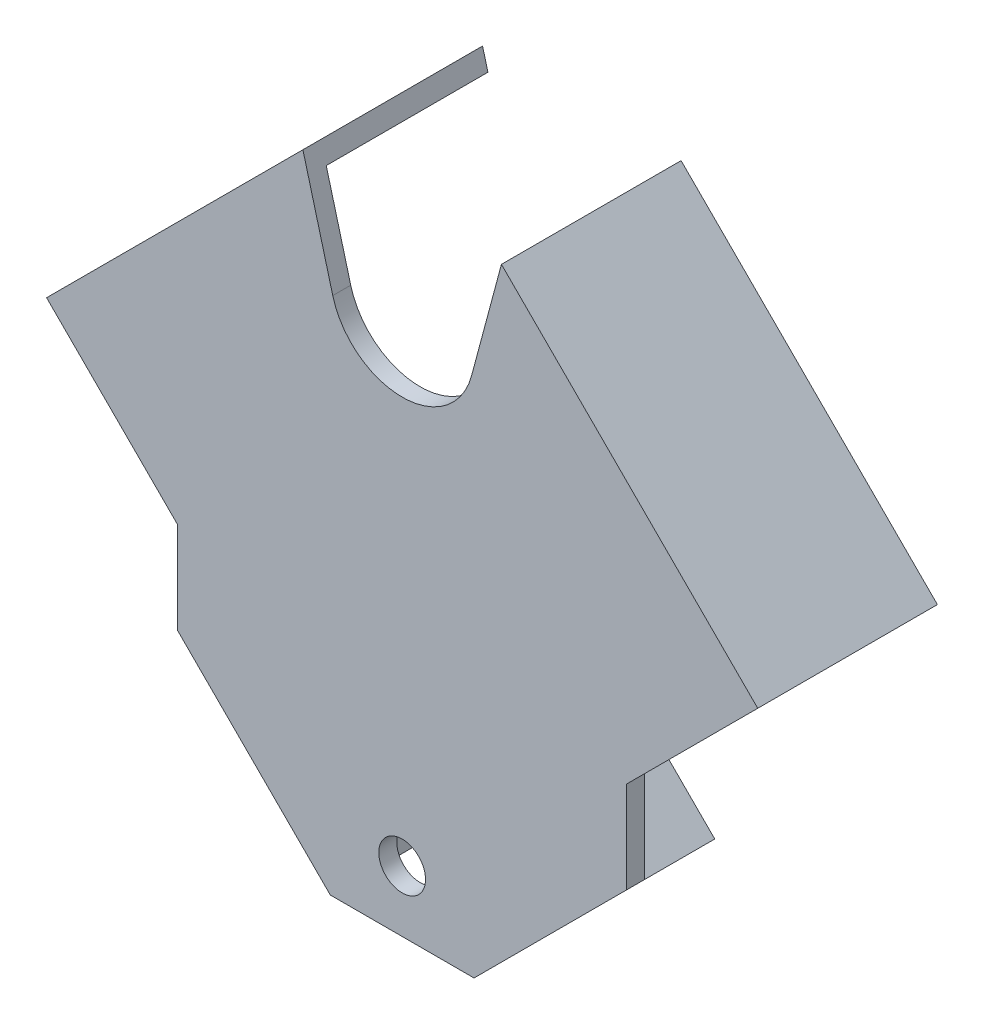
ISO-10303-21;
HEADER;
FILE_DESCRIPTION(('STEP AP214'),'2;1');
FILE_NAME('part.step','',(''),(''),'','','');
FILE_SCHEMA(('AUTOMOTIVE_DESIGN { 1 0 10303 214 1 1 1 1 }'));
ENDSEC;
DATA;
#1=APPLICATION_CONTEXT('core data for automotive mechanical design processes');
#2=APPLICATION_PROTOCOL_DEFINITION('international standard','automotive_design',2000,#1);
#3=PRODUCT_CONTEXT('',#1,'mechanical');
#4=PRODUCT('Part','Part','',(#3));
#5=PRODUCT_RELATED_PRODUCT_CATEGORY('part','',(#4));
#6=PRODUCT_DEFINITION_FORMATION('','',#4);
#7=PRODUCT_DEFINITION_CONTEXT('part definition',#1,'design');
#8=PRODUCT_DEFINITION('design','',#6,#7);
#9=PRODUCT_DEFINITION_SHAPE('','',#8);
#10=(LENGTH_UNIT() NAMED_UNIT(*) SI_UNIT(.MILLI.,.METRE.));
#11=(NAMED_UNIT(*) PLANE_ANGLE_UNIT() SI_UNIT($,.RADIAN.));
#12=(NAMED_UNIT(*) SI_UNIT($,.STERADIAN.) SOLID_ANGLE_UNIT());
#13=UNCERTAINTY_MEASURE_WITH_UNIT(LENGTH_MEASURE(1.E-05),#10,'distance_accuracy_value','');
#14=(GEOMETRIC_REPRESENTATION_CONTEXT(3) GLOBAL_UNCERTAINTY_ASSIGNED_CONTEXT((#13)) GLOBAL_UNIT_ASSIGNED_CONTEXT((#10,
#11,#12)) REPRESENTATION_CONTEXT('',''));
#15=CARTESIAN_POINT('',(0.,0.,0.));
#16=DIRECTION('',(0.,0.,1.));
#17=DIRECTION('',(1.,0.,0.));
#18=AXIS2_PLACEMENT_3D('',#15,#16,#17);
#19=CARTESIAN_POINT('',(0.,39.8578643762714,-136.728956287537));
#20=DIRECTION('',(0.,0.,1.));
#21=DIRECTION('',(1.,0.,0.));
#22=AXIS2_PLACEMENT_3D('',#19,#20,#21);
#23=CYLINDRICAL_SURFACE('',#22,5.);
#24=DIRECTION('',(0.,0.,1.));
#25=VECTOR('',#24,1.);
#26=CARTESIAN_POINT('',(-3.53553390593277,43.3933982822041,-136.728956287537));
#27=LINE('',#26,#25);
#28=CARTESIAN_POINT('',(-3.53553390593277,43.3933982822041,-14.662983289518));
#29=VERTEX_POINT('',#28);
#30=CARTESIAN_POINT('',(-3.53553390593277,43.3933982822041,-2.5));
#31=VERTEX_POINT('',#30);
#32=EDGE_CURVE('E362',#29,#31,#27,.T.);
#33=ORIENTED_EDGE('',*,*,#32,.F.);
#34=CARTESIAN_POINT('',(-3.53553390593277,43.3933982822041,-14.662983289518));
#35=CARTESIAN_POINT('',(-3.43975250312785,43.4892161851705,-14.643342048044));
#36=CARTESIAN_POINT('',(-3.33979429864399,43.5813519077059,-14.6262838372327));
#37=CARTESIAN_POINT('',(-3.13236702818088,43.7574423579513,-14.5965813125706));
#38=CARTESIAN_POINT('',(-3.02490093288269,43.8414002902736,-14.5839352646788));
#39=CARTESIAN_POINT('',(-2.80345193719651,44.0002316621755,-14.5623128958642));
#40=CARTESIAN_POINT('',(-2.68948289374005,44.0751234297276,-14.5533290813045));
#41=CARTESIAN_POINT('',(-2.45566048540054,44.2154230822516,-14.5382527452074));
#42=CARTESIAN_POINT('',(-2.3358066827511,44.2808302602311,-14.5321604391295));
#43=CARTESIAN_POINT('',(-2.09118041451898,44.4016027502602,-14.522181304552));
#44=CARTESIAN_POINT('',(-1.96641207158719,44.456976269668,-14.5182926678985));
#45=CARTESIAN_POINT('',(-1.71273154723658,44.5573492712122,-14.5120972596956));
#46=CARTESIAN_POINT('',(-1.58381928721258,44.6023485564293,-14.5097905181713));
#47=CARTESIAN_POINT('',(-1.32268001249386,44.6816748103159,-14.5062369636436));
#48=CARTESIAN_POINT('',(-1.19045164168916,44.7159973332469,-14.5049905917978));
#49=CARTESIAN_POINT('',(-0.92368212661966,44.7736988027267,-14.5031492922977));
#50=CARTESIAN_POINT('',(-0.789141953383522,44.7970822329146,-14.5025540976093));
#51=CARTESIAN_POINT('',(-0.515287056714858,44.8332053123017,-14.5017179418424));
#52=CARTESIAN_POINT('',(-0.375936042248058,44.8456706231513,-14.5014860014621));
#53=CARTESIAN_POINT('',(-0.0966776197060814,44.8588837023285,-14.5012419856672));
#54=CARTESIAN_POINT('',(0.0432297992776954,44.859631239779,-14.5012299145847));
#55=CARTESIAN_POINT('',(0.32262407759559,44.8494028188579,-14.5014159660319));
#56=CARTESIAN_POINT('',(0.462110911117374,44.8384261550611,-14.5016141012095));
#57=CARTESIAN_POINT('',(0.739721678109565,44.8048198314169,-14.5023636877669));
#58=CARTESIAN_POINT('',(0.877845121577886,44.7821861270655,-14.5029152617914));
#59=CARTESIAN_POINT('',(1.15245504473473,44.7252677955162,-14.5046678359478));
#60=CARTESIAN_POINT('',(1.28892845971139,44.6909201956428,-14.5058723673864));
#61=CARTESIAN_POINT('',(1.55848272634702,44.6108530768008,-14.5093699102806));
#62=CARTESIAN_POINT('',(1.69156356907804,44.5651335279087,-14.5116629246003));
#63=CARTESIAN_POINT('',(1.95327994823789,44.4626903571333,-14.5178995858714));
#64=CARTESIAN_POINT('',(2.08191862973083,44.4059747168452,-14.5218420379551));
#65=CARTESIAN_POINT('',(2.33385504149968,44.2819858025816,-14.5320439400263));
#66=CARTESIAN_POINT('',(2.45715354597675,44.2147140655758,-14.5383030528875));
#67=CARTESIAN_POINT('',(2.75205563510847,44.0372976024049,-14.557432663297));
#68=CARTESIAN_POINT('',(2.92024339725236,43.9215350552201,-14.5720136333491));
#69=CARTESIAN_POINT('',(3.16041906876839,43.7337022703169,-14.6006015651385));
#70=CARTESIAN_POINT('',(3.23847130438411,43.6687151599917,-14.6112524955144));
#71=CARTESIAN_POINT('',(3.3902912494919,43.5343032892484,-14.6351163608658));
#72=CARTESIAN_POINT('',(3.46405744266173,43.4648769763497,-14.6483301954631));
#73=CARTESIAN_POINT('',(3.5355339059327,43.3933982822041,-14.662983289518));
#74=B_SPLINE_CURVE_WITH_KNOTS('',3,(#34,#35,#36,#37,#38,#39,#40,#41,#42,#43,#44,#45,#46,#47,#48,
#49,#50,#51,#52,#53,#54,#55,#56,#57,#58,#59,#60,#61,#62,#63,#64,#65,#66,#67,#68,#69,#70,#71,#72,
#73),.UNSPECIFIED.,.F.,.F.,(4,2,2,2,2,2,2,2,2,2,2,2,2,2,2,2,2,2,2,4),(0.,0.410520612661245,
0.820879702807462,1.23039485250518,1.63994051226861,2.04914964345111,2.45836654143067,
2.86775360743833,3.27697272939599,3.69620139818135,4.11543832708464,4.53470048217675,
4.95410820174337,5.37580711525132,5.79750713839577,6.21890220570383,6.64023597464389,
7.25240776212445,7.55859012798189,7.86488016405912),.UNSPECIFIED.);
#75=CARTESIAN_POINT('',(3.5355339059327,43.3933982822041,-14.662983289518));
#76=VERTEX_POINT('',#75);
#77=EDGE_CURVE('E306',#29,#76,#74,.T.);
#78=ORIENTED_EDGE('',*,*,#77,.T.);
#79=DIRECTION('',(0.,0.,1.));
#80=VECTOR('',#79,1.);
#81=CARTESIAN_POINT('',(3.5355339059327,43.3933982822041,-136.728956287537));
#82=LINE('',#81,#80);
#83=CARTESIAN_POINT('',(3.5355339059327,43.3933982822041,-2.5));
#84=VERTEX_POINT('',#83);
#85=EDGE_CURVE('E575',#76,#84,#82,.T.);
#86=ORIENTED_EDGE('',*,*,#85,.T.);
#87=CARTESIAN_POINT('',(0.,39.8578643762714,-2.5));
#88=DIRECTION('',(0.,0.,1.));
#89=DIRECTION('',(1.,0.,0.));
#90=AXIS2_PLACEMENT_3D('',#87,#88,#89);
#91=CIRCLE('',#90,5.);
#92=EDGE_CURVE('E366',#84,#31,#91,.T.);
#93=ORIENTED_EDGE('',*,*,#92,.T.);
#94=EDGE_LOOP('',(#33,#78,#86,#93));
#95=FACE_BOUND('',#94,.T.);
#96=ADVANCED_FACE('F37',(#95),#23,.F.);
#97=CARTESIAN_POINT('',(0.,39.8578643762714,-136.728956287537));
#98=DIRECTION('',(0.,0.,1.));
#99=DIRECTION('',(1.,0.,0.));
#100=AXIS2_PLACEMENT_3D('',#97,#98,#99);
#101=CYLINDRICAL_SURFACE('',#100,10.);
#102=DIRECTION('',(0.,0.,1.));
#103=VECTOR('',#102,1.);
#104=CARTESIAN_POINT('',(7.07106781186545,46.9289321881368,-136.728956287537));
#105=LINE('',#104,#103);
#106=CARTESIAN_POINT('',(7.07106781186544,46.9289321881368,-14.5));
#107=VERTEX_POINT('',#106);
#108=CARTESIAN_POINT('',(7.07106781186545,46.9289321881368,-2.5));
#109=VERTEX_POINT('',#108);
#110=EDGE_CURVE('E396',#107,#109,#105,.T.);
#111=ORIENTED_EDGE('',*,*,#110,.F.);
#112=CARTESIAN_POINT('',(0.,39.8578643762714,-14.5));
#113=DIRECTION('',(0.,0.,1.));
#114=DIRECTION('',(1.,0.,0.));
#115=AXIS2_PLACEMENT_3D('',#112,#113,#114);
#116=CIRCLE('',#115,10.);
#117=CARTESIAN_POINT('',(-7.07106781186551,46.9289321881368,-14.5));
#118=VERTEX_POINT('',#117);
#119=EDGE_CURVE('E273',#107,#118,#116,.T.);
#120=ORIENTED_EDGE('',*,*,#119,.T.);
#121=DIRECTION('',(0.,0.,1.));
#122=VECTOR('',#121,1.);
#123=CARTESIAN_POINT('',(-7.07106781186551,46.9289321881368,-136.728956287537));
#124=LINE('',#123,#122);
#125=CARTESIAN_POINT('',(-7.07106781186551,46.9289321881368,-2.5));
#126=VERTEX_POINT('',#125);
#127=EDGE_CURVE('E391',#118,#126,#124,.T.);
#128=ORIENTED_EDGE('',*,*,#127,.T.);
#129=CARTESIAN_POINT('',(0.,39.8578643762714,-2.5));
#130=DIRECTION('',(0.,0.,-1.));
#131=DIRECTION('',(1.,0.,0.));
#132=AXIS2_PLACEMENT_3D('',#129,#130,#131);
#133=CIRCLE('',#132,10.);
#134=EDGE_CURVE('E390',#126,#109,#133,.T.);
#135=ORIENTED_EDGE('',*,*,#134,.T.);
#136=EDGE_LOOP('',(#111,#120,#128,#135));
#137=FACE_BOUND('',#136,.T.);
#138=ADVANCED_FACE('F332',(#137),#101,.T.);
#139=CARTESIAN_POINT('',(0.,150.,-2.5));
#140=DIRECTION('',(0.,0.,1.));
#141=DIRECTION('',(1.,0.,0.));
#142=AXIS2_PLACEMENT_3D('',#139,#140,#141);
#143=PLANE('',#142);
#144=CARTESIAN_POINT('',(0.,17.,-2.5));
#145=DIRECTION('',(0.,0.,1.));
#146=DIRECTION('',(1.,0.,0.));
#147=AXIS2_PLACEMENT_3D('',#144,#145,#146);
#148=CIRCLE('',#147,6.5);
#149=CARTESIAN_POINT('',(6.5,17.,-2.5));
#150=VERTEX_POINT('',#149);
#151=EDGE_CURVE('E446',#150,#150,#148,.T.);
#152=ORIENTED_EDGE('',*,*,#151,.T.);
#153=EDGE_LOOP('',(#152));
#154=FACE_BOUND('',#153,.T.);
#155=DIRECTION('',(0.707106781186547,-0.707106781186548,0.));
#156=VECTOR('',#155,1.);
#157=CARTESIAN_POINT('',(-29.9289321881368,17.,-2.5));
#158=LINE('',#157,#156);
#159=CARTESIAN_POINT('',(-27.8076118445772,14.8786796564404,-2.5));
#160=VERTEX_POINT('',#159);
#161=CARTESIAN_POINT('',(-20.,7.07106781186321,-2.5));
#162=VERTEX_POINT('',#161);
#163=EDGE_CURVE('E381',#160,#162,#158,.T.);
#164=ORIENTED_EDGE('',*,*,#163,.F.);
#165=CARTESIAN_POINT('',(-25.6862915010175,17.,-2.5));
#166=DIRECTION('',(0.,0.,1.));
#167=DIRECTION('',(1.,0.,0.));
#168=AXIS2_PLACEMENT_3D('',#165,#166,#167);
#169=CIRCLE('',#168,3.);
#170=CARTESIAN_POINT('',(-27.8076118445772,19.1213203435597,-2.5));
#171=VERTEX_POINT('',#170);
#172=EDGE_CURVE('E543',#160,#171,#169,.F.);
#173=ORIENTED_EDGE('',*,*,#172,.T.);
#174=DIRECTION('',(-0.707106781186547,-0.707106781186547,0.));
#175=VECTOR('',#174,1.);
#176=CARTESIAN_POINT('',(-3.53553390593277,43.3933982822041,-2.5));
#177=LINE('',#176,#175);
#178=EDGE_CURVE('E371',#31,#171,#177,.T.);
#179=ORIENTED_EDGE('',*,*,#178,.F.);
#180=ORIENTED_EDGE('',*,*,#92,.F.);
#181=DIRECTION('',(-0.707106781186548,0.707106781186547,0.));
#182=VECTOR('',#181,1.);
#183=CARTESIAN_POINT('',(29.9289321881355,17.0000000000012,-2.5));
#184=LINE('',#183,#182);
#185=CARTESIAN_POINT('',(27.8076118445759,19.1213203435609,-2.5));
#186=VERTEX_POINT('',#185);
#187=EDGE_CURVE('E573',#186,#84,#184,.T.);
#188=ORIENTED_EDGE('',*,*,#187,.F.);
#189=CARTESIAN_POINT('',(25.6862915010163,17.0000000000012,-2.5));
#190=DIRECTION('',(0.,0.,1.));
#191=DIRECTION('',(1.,0.,0.));
#192=AXIS2_PLACEMENT_3D('',#189,#190,#191);
#193=CIRCLE('',#192,3.);
#194=CARTESIAN_POINT('',(27.8076118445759,14.8786796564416,-2.5));
#195=VERTEX_POINT('',#194);
#196=EDGE_CURVE('E541',#186,#195,#193,.F.);
#197=ORIENTED_EDGE('',*,*,#196,.T.);
#198=DIRECTION('',(0.707106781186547,0.707106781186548,0.));
#199=VECTOR('',#198,1.);
#200=CARTESIAN_POINT('',(20.,7.0710678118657,-2.5));
#201=LINE('',#200,#199);
#202=CARTESIAN_POINT('',(20.,7.0710678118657,-2.5));
#203=VERTEX_POINT('',#202);
#204=EDGE_CURVE('E576',#203,#195,#201,.T.);
#205=ORIENTED_EDGE('',*,*,#204,.F.);
#206=DIRECTION('',(0.,1.,0.));
#207=VECTOR('',#206,1.);
#208=CARTESIAN_POINT('',(20.,2.22044604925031E-13,-2.5));
#209=LINE('',#208,#207);
#210=CARTESIAN_POINT('',(20.,2.22044604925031E-13,-2.5));
#211=VERTEX_POINT('',#210);
#212=EDGE_CURVE('E402',#211,#203,#209,.T.);
#213=ORIENTED_EDGE('',*,*,#212,.F.);
#214=DIRECTION('',(1.,0.,0.));
#215=VECTOR('',#214,1.);
#216=CARTESIAN_POINT('',(-20.,0.,-2.5));
#217=LINE('',#216,#215);
#218=CARTESIAN_POINT('',(-20.,0.,-2.5));
#219=VERTEX_POINT('',#218);
#220=EDGE_CURVE('E455',#219,#211,#217,.T.);
#221=ORIENTED_EDGE('',*,*,#220,.F.);
#222=DIRECTION('',(0.,-1.,0.));
#223=VECTOR('',#222,1.);
#224=CARTESIAN_POINT('',(-20.,0.,-2.5));
#225=LINE('',#224,#223);
#226=EDGE_CURVE('E380',#162,#219,#225,.T.);
#227=ORIENTED_EDGE('',*,*,#226,.F.);
#228=EDGE_LOOP('',(#164,#173,#179,#180,#188,#197,#205,#213,#221,#227));
#229=FACE_BOUND('',#228,.T.);
#230=ADVANCED_FACE('F357',(#154,#229),#143,.F.);
#231=DIRECTION('',(0.707106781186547,0.707106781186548,0.));
#232=VECTOR('',#231,1.);
#233=CARTESIAN_POINT('',(-7.07106781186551,46.9289321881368,-2.5));
#234=LINE('',#233,#232);
#235=CARTESIAN_POINT('',(-37.0000000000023,17.,-2.5));
#236=VERTEX_POINT('',#235);
#237=EDGE_CURVE('E387',#236,#126,#234,.T.);
#238=ORIENTED_EDGE('',*,*,#237,.F.);
#239=DIRECTION('',(0.707106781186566,-0.707106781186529,0.));
#240=VECTOR('',#239,1.);
#241=CARTESIAN_POINT('',(-62.5000000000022,42.5,-2.5));
#242=LINE('',#241,#240);
#243=CARTESIAN_POINT('',(-62.5000000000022,42.5,-2.5));
#244=VERTEX_POINT('',#243);
#245=EDGE_CURVE('E462',#244,#236,#242,.T.);
#246=ORIENTED_EDGE('',*,*,#245,.F.);
#247=DIRECTION('',(0.,-1.,0.));
#248=VECTOR('',#247,1.);
#249=CARTESIAN_POINT('',(-62.5000000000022,68.0216387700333,-2.5));
#250=LINE('',#249,#248);
#251=CARTESIAN_POINT('',(-62.5000000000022,68.0216387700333,-2.5));
#252=VERTEX_POINT('',#251);
#253=EDGE_CURVE('E505',#252,#244,#250,.T.);
#254=ORIENTED_EDGE('',*,*,#253,.F.);
#255=DIRECTION('',(0.707106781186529,-0.707106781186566,0.));
#256=VECTOR('',#255,1.);
#257=CARTESIAN_POINT('',(-95.4265181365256,100.948156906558,-2.5));
#258=LINE('',#257,#256);
#259=CARTESIAN_POINT('',(-95.4265181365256,100.948156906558,-2.5));
#260=VERTEX_POINT('',#259);
#261=EDGE_CURVE('E503',#260,#252,#258,.T.);
#262=ORIENTED_EDGE('',*,*,#261,.F.);
#263=DIRECTION('',(-0.707106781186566,-0.707106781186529,0.));
#264=VECTOR('',#263,1.);
#265=CARTESIAN_POINT('',(-26.1300535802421,170.244621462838,-2.5));
#266=LINE('',#265,#264);
#267=CARTESIAN_POINT('',(-26.1300535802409,170.244621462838,-2.5));
#268=VERTEX_POINT('',#267);
#269=EDGE_CURVE('E500',#268,#260,#266,.T.);
#270=ORIENTED_EDGE('',*,*,#269,.F.);
#271=DIRECTION('',(-0.258819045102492,0.965925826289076,0.));
#272=VECTOR('',#271,1.);
#273=CARTESIAN_POINT('',(-19.3185165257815,144.82361909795,-2.5));
#274=LINE('',#273,#272);
#275=CARTESIAN_POINT('',(-19.3185165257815,144.82361909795,-2.5));
#276=VERTEX_POINT('',#275);
#277=EDGE_CURVE('E497',#276,#268,#274,.T.);
#278=ORIENTED_EDGE('',*,*,#277,.F.);
#279=CARTESIAN_POINT('',(0.,150.,-2.5));
#280=DIRECTION('',(0.,0.,-1.));
#281=DIRECTION('',(1.,0.,0.));
#282=AXIS2_PLACEMENT_3D('',#279,#280,#281);
#283=CIRCLE('',#282,20.);
#284=CARTESIAN_POINT('',(19.3185165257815,144.82361909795,-2.5));
#285=VERTEX_POINT('',#284);
#286=EDGE_CURVE('E495',#285,#276,#283,.T.);
#287=ORIENTED_EDGE('',*,*,#286,.F.);
#288=DIRECTION('',(-0.258819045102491,-0.965925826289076,0.));
#289=VECTOR('',#288,1.);
#290=CARTESIAN_POINT('',(19.3185165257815,144.82361909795,-2.5));
#291=LINE('',#290,#289);
#292=CARTESIAN_POINT('',(26.1300535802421,170.244621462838,-2.5));
#293=VERTEX_POINT('',#292);
#294=EDGE_CURVE('E493',#293,#285,#291,.T.);
#295=ORIENTED_EDGE('',*,*,#294,.F.);
#296=DIRECTION('',(-0.707106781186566,0.707106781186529,0.));
#297=VECTOR('',#296,1.);
#298=CARTESIAN_POINT('',(26.1300535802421,170.244621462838,-2.5));
#299=LINE('',#298,#297);
#300=CARTESIAN_POINT('',(95.4265181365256,100.948156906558,-2.5));
#301=VERTEX_POINT('',#300);
#302=EDGE_CURVE('E490',#301,#293,#299,.T.);
#303=ORIENTED_EDGE('',*,*,#302,.F.);
#304=DIRECTION('',(0.707106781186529,0.707106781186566,0.));
#305=VECTOR('',#304,1.);
#306=CARTESIAN_POINT('',(95.4265181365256,100.948156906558,-2.5));
#307=LINE('',#306,#305);
#308=CARTESIAN_POINT('',(62.5000000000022,68.0216387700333,-2.5));
#309=VERTEX_POINT('',#308);
#310=EDGE_CURVE('E487',#309,#301,#307,.T.);
#311=ORIENTED_EDGE('',*,*,#310,.F.);
#312=DIRECTION('',(0.,1.,0.));
#313=VECTOR('',#312,1.);
#314=CARTESIAN_POINT('',(62.5000000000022,68.0216387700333,-2.5));
#315=LINE('',#314,#313);
#316=CARTESIAN_POINT('',(62.5000000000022,42.5,-2.5));
#317=VERTEX_POINT('',#316);
#318=EDGE_CURVE('E485',#317,#309,#315,.T.);
#319=ORIENTED_EDGE('',*,*,#318,.F.);
#320=DIRECTION('',(0.707106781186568,0.707106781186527,0.));
#321=VECTOR('',#320,1.);
#322=CARTESIAN_POINT('',(62.5000000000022,42.5,-2.5));
#323=LINE('',#322,#321);
#324=CARTESIAN_POINT('',(37.000000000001,17.0000000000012,-2.5));
#325=VERTEX_POINT('',#324);
#326=EDGE_CURVE('E483',#325,#317,#323,.T.);
#327=ORIENTED_EDGE('',*,*,#326,.F.);
#328=DIRECTION('',(0.707106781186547,-0.707106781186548,0.));
#329=VECTOR('',#328,1.);
#330=CARTESIAN_POINT('',(37.000000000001,17.0000000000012,-2.5));
#331=LINE('',#330,#329);
#332=EDGE_CURVE('E395',#109,#325,#331,.T.);
#333=ORIENTED_EDGE('',*,*,#332,.F.);
#334=ORIENTED_EDGE('',*,*,#134,.F.);
#335=EDGE_LOOP('',(#238,#246,#254,#262,#270,#278,#287,#295,#303,#311,#319,#327,#333,#334));
#336=FACE_BOUND('',#335,.T.);
#337=ADVANCED_FACE('F647',(#336),#143,.F.);
#338=CARTESIAN_POINT('',(0.,150.,2.5));
#339=DIRECTION('',(0.,0.,1.));
#340=DIRECTION('',(1.,0.,0.));
#341=AXIS2_PLACEMENT_3D('',#338,#339,#340);
#342=PLANE('',#341);
#343=DIRECTION('',(1.,0.,0.));
#344=VECTOR('',#343,1.);
#345=CARTESIAN_POINT('',(-20.,0.,2.5));
#346=LINE('',#345,#344);
#347=CARTESIAN_POINT('',(-20.,0.,2.5));
#348=VERTEX_POINT('',#347);
#349=CARTESIAN_POINT('',(20.,2.22044604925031E-13,2.5));
#350=VERTEX_POINT('',#349);
#351=EDGE_CURVE('E458',#348,#350,#346,.T.);
#352=ORIENTED_EDGE('',*,*,#351,.T.);
#353=DIRECTION('',(0.707106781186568,0.707106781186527,0.));
#354=VECTOR('',#353,1.);
#355=CARTESIAN_POINT('',(62.5000000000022,42.5,2.5));
#356=LINE('',#355,#354);
#357=CARTESIAN_POINT('',(62.5000000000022,42.5,2.5));
#358=VERTEX_POINT('',#357);
#359=EDGE_CURVE('E461',#350,#358,#356,.T.);
#360=ORIENTED_EDGE('',*,*,#359,.T.);
#361=DIRECTION('',(0.,1.,0.));
#362=VECTOR('',#361,1.);
#363=CARTESIAN_POINT('',(62.5000000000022,68.0216387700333,2.5));
#364=LINE('',#363,#362);
#365=CARTESIAN_POINT('',(62.5000000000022,68.0216387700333,2.5));
#366=VERTEX_POINT('',#365);
#367=EDGE_CURVE('E464',#358,#366,#364,.T.);
#368=ORIENTED_EDGE('',*,*,#367,.T.);
#369=DIRECTION('',(0.707106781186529,0.707106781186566,0.));
#370=VECTOR('',#369,1.);
#371=CARTESIAN_POINT('',(95.4265181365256,100.948156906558,2.5));
#372=LINE('',#371,#370);
#373=CARTESIAN_POINT('',(98.9620520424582,104.483690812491,2.5));
#374=VERTEX_POINT('',#373);
#375=EDGE_CURVE('E466',#366,#374,#372,.T.);
#376=ORIENTED_EDGE('',*,*,#375,.T.);
#377=DIRECTION('',(0.707106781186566,-0.707106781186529,0.));
#378=VECTOR('',#377,1.);
#379=CARTESIAN_POINT('',(98.9620520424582,104.483690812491,2.5));
#380=LINE('',#379,#378);
#381=CARTESIAN_POINT('',(27.6243460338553,175.82139682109,2.5));
#382=VERTEX_POINT('',#381);
#383=EDGE_CURVE('E440',#382,#374,#380,.T.);
#384=ORIENTED_EDGE('',*,*,#383,.F.);
#385=DIRECTION('',(-0.258819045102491,-0.965925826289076,0.));
#386=VECTOR('',#385,1.);
#387=CARTESIAN_POINT('',(19.3185165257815,144.82361909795,2.5));
#388=LINE('',#387,#386);
#389=CARTESIAN_POINT('',(19.3185165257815,144.82361909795,2.5));
#390=VERTEX_POINT('',#389);
#391=EDGE_CURVE('E468',#382,#390,#388,.T.);
#392=ORIENTED_EDGE('',*,*,#391,.T.);
#393=CARTESIAN_POINT('',(0.,150.,2.5));
#394=DIRECTION('',(0.,0.,-1.));
#395=DIRECTION('',(1.,0.,0.));
#396=AXIS2_PLACEMENT_3D('',#393,#394,#395);
#397=CIRCLE('',#396,20.);
#398=CARTESIAN_POINT('',(-19.3185165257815,144.82361909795,2.5));
#399=VERTEX_POINT('',#398);
#400=EDGE_CURVE('E470',#390,#399,#397,.T.);
#401=ORIENTED_EDGE('',*,*,#400,.T.);
#402=DIRECTION('',(-0.258819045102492,0.965925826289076,0.));
#403=VECTOR('',#402,1.);
#404=CARTESIAN_POINT('',(-19.3185165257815,144.82361909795,2.5));
#405=LINE('',#404,#403);
#406=CARTESIAN_POINT('',(-27.6243460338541,175.82139682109,2.5));
#407=VERTEX_POINT('',#406);
#408=EDGE_CURVE('E472',#399,#407,#405,.T.);
#409=ORIENTED_EDGE('',*,*,#408,.T.);
#410=DIRECTION('',(0.707106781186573,0.707106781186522,0.));
#411=VECTOR('',#410,1.);
#412=CARTESIAN_POINT('',(-98.9620520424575,104.483690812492,2.5));
#413=LINE('',#412,#411);
#414=CARTESIAN_POINT('',(-98.9620520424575,104.483690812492,2.5));
#415=VERTEX_POINT('',#414);
#416=EDGE_CURVE('E417',#415,#407,#413,.T.);
#417=ORIENTED_EDGE('',*,*,#416,.F.);
#418=DIRECTION('',(0.707106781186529,-0.707106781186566,0.));
#419=VECTOR('',#418,1.);
#420=CARTESIAN_POINT('',(-95.4265181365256,100.948156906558,2.5));
#421=LINE('',#420,#419);
#422=CARTESIAN_POINT('',(-62.5000000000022,68.0216387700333,2.5));
#423=VERTEX_POINT('',#422);
#424=EDGE_CURVE('E474',#415,#423,#421,.T.);
#425=ORIENTED_EDGE('',*,*,#424,.T.);
#426=DIRECTION('',(0.,-1.,0.));
#427=VECTOR('',#426,1.);
#428=CARTESIAN_POINT('',(-62.5000000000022,68.0216387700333,2.5));
#429=LINE('',#428,#427);
#430=CARTESIAN_POINT('',(-62.5000000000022,42.5,2.5));
#431=VERTEX_POINT('',#430);
#432=EDGE_CURVE('E476',#423,#431,#429,.T.);
#433=ORIENTED_EDGE('',*,*,#432,.T.);
#434=DIRECTION('',(0.707106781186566,-0.707106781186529,0.));
#435=VECTOR('',#434,1.);
#436=CARTESIAN_POINT('',(-62.5000000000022,42.5,2.5));
#437=LINE('',#436,#435);
#438=EDGE_CURVE('E478',#431,#348,#437,.T.);
#439=ORIENTED_EDGE('',*,*,#438,.T.);
#440=EDGE_LOOP('',(#352,#360,#368,#376,#384,#392,#401,#409,#417,#425,#433,#439));
#441=FACE_BOUND('',#440,.T.);
#442=CARTESIAN_POINT('',(0.,17.,2.5));
#443=DIRECTION('',(0.,0.,1.));
#444=DIRECTION('',(1.,0.,0.));
#445=AXIS2_PLACEMENT_3D('',#442,#443,#444);
#446=CIRCLE('',#445,6.5);
#447=CARTESIAN_POINT('',(6.5,17.,2.5));
#448=VERTEX_POINT('',#447);
#449=EDGE_CURVE('E452',#448,#448,#446,.T.);
#450=ORIENTED_EDGE('',*,*,#449,.F.);
#451=EDGE_LOOP('',(#450));
#452=FACE_BOUND('',#451,.T.);
#453=ADVANCED_FACE('F637',(#441,#452),#342,.T.);
#454=CARTESIAN_POINT('',(-20.,0.,2.5));
#455=DIRECTION('',(0.,1.,0.));
#456=DIRECTION('',(-1.,0.,0.));
#457=AXIS2_PLACEMENT_3D('',#454,#455,#456);
#458=PLANE('',#457);
#459=ORIENTED_EDGE('',*,*,#220,.T.);
#460=DIRECTION('',(0.,0.,-1.));
#461=VECTOR('',#460,1.);
#462=CARTESIAN_POINT('',(20.,2.22044604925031E-13,2.5));
#463=LINE('',#462,#461);
#464=EDGE_CURVE('E529',#350,#211,#463,.T.);
#465=ORIENTED_EDGE('',*,*,#464,.F.);
#466=ORIENTED_EDGE('',*,*,#351,.F.);
#467=DIRECTION('',(0.,0.,-1.));
#468=VECTOR('',#467,1.);
#469=CARTESIAN_POINT('',(-20.,0.,2.5));
#470=LINE('',#469,#468);
#471=EDGE_CURVE('E480',#348,#219,#470,.T.);
#472=ORIENTED_EDGE('',*,*,#471,.T.);
#473=EDGE_LOOP('',(#459,#465,#466,#472));
#474=FACE_BOUND('',#473,.T.);
#475=ADVANCED_FACE('F634',(#474),#458,.F.);
#476=CARTESIAN_POINT('',(62.5000000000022,42.5,2.5));
#477=DIRECTION('',(-0.707106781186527,0.707106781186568,0.));
#478=DIRECTION('',(-0.707106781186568,-0.707106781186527,0.));
#479=AXIS2_PLACEMENT_3D('',#476,#477,#478);
#480=PLANE('',#479);
#481=ORIENTED_EDGE('',*,*,#464,.T.);
#482=DIRECTION('',(0.,0.,1.));
#483=VECTOR('',#482,1.);
#484=CARTESIAN_POINT('',(20.,2.22044604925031E-13,-136.728956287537));
#485=LINE('',#484,#483);
#486=CARTESIAN_POINT('',(20.,2.22044604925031E-13,-47.5));
#487=VERTEX_POINT('',#486);
#488=EDGE_CURVE('E400',#487,#211,#485,.T.);
#489=ORIENTED_EDGE('',*,*,#488,.F.);
#490=DIRECTION('',(-0.707106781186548,-0.707106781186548,0.));
#491=VECTOR('',#490,1.);
#492=CARTESIAN_POINT('',(20.,2.22044604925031E-13,-47.5));
#493=LINE('',#492,#491);
#494=CARTESIAN_POINT('',(37.000000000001,17.0000000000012,-47.5));
#495=VERTEX_POINT('',#494);
#496=EDGE_CURVE('E399',#495,#487,#493,.T.);
#497=ORIENTED_EDGE('',*,*,#496,.F.);
#498=DIRECTION('',(0.,0.,1.));
#499=VECTOR('',#498,1.);
#500=CARTESIAN_POINT('',(37.000000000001,17.0000000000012,-136.728956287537));
#501=LINE('',#500,#499);
#502=EDGE_CURVE('E397',#495,#325,#501,.T.);
#503=ORIENTED_EDGE('',*,*,#502,.T.);
#504=ORIENTED_EDGE('',*,*,#326,.T.);
#505=DIRECTION('',(0.,0.,-1.));
#506=VECTOR('',#505,1.);
#507=CARTESIAN_POINT('',(62.5000000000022,42.5,2.5));
#508=LINE('',#507,#506);
#509=EDGE_CURVE('E526',#358,#317,#508,.T.);
#510=ORIENTED_EDGE('',*,*,#509,.F.);
#511=ORIENTED_EDGE('',*,*,#359,.F.);
#512=EDGE_LOOP('',(#481,#489,#497,#503,#504,#510,#511));
#513=FACE_BOUND('',#512,.T.);
#514=ADVANCED_FACE('F655',(#513),#480,.F.);
#515=CARTESIAN_POINT('',(62.5000000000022,68.0216387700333,2.5));
#516=DIRECTION('',(-1.,0.,0.));
#517=DIRECTION('',(0.,0.,1.));
#518=AXIS2_PLACEMENT_3D('',#515,#516,#517);
#519=PLANE('',#518);
#520=ORIENTED_EDGE('',*,*,#318,.T.);
#521=DIRECTION('',(0.,0.,-1.));
#522=VECTOR('',#521,1.);
#523=CARTESIAN_POINT('',(62.5000000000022,68.0216387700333,2.5));
#524=LINE('',#523,#522);
#525=EDGE_CURVE('E523',#366,#309,#524,.T.);
#526=ORIENTED_EDGE('',*,*,#525,.F.);
#527=ORIENTED_EDGE('',*,*,#367,.F.);
#528=ORIENTED_EDGE('',*,*,#509,.T.);
#529=EDGE_LOOP('',(#520,#526,#527,#528));
#530=FACE_BOUND('',#529,.T.);
#531=ADVANCED_FACE('F660',(#530),#519,.F.);
#532=CARTESIAN_POINT('',(95.4265181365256,100.948156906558,2.5));
#533=DIRECTION('',(-0.707106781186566,0.707106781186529,0.));
#534=DIRECTION('',(-0.707106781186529,-0.707106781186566,0.));
#535=AXIS2_PLACEMENT_3D('',#532,#533,#534);
#536=PLANE('',#535);
#537=ORIENTED_EDGE('',*,*,#310,.T.);
#538=DIRECTION('',(0.,0.,-1.));
#539=VECTOR('',#538,1.);
#540=CARTESIAN_POINT('',(95.4265181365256,100.948156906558,2.5));
#541=LINE('',#540,#539);
#542=CARTESIAN_POINT('',(95.4265181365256,100.948156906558,-47.5));
#543=VERTEX_POINT('',#542);
#544=EDGE_CURVE('E447',#301,#543,#541,.T.);
#545=ORIENTED_EDGE('',*,*,#544,.T.);
#546=DIRECTION('',(-0.707106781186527,-0.707106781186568,0.));
#547=VECTOR('',#546,1.);
#548=CARTESIAN_POINT('',(95.4265181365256,100.948156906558,-47.5));
#549=LINE('',#548,#547);
#550=CARTESIAN_POINT('',(98.9620520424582,104.483690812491,-47.5));
#551=VERTEX_POINT('',#550);
#552=EDGE_CURVE('E434',#551,#543,#549,.T.);
#553=ORIENTED_EDGE('',*,*,#552,.F.);
#554=DIRECTION('',(0.,0.,-1.));
#555=VECTOR('',#554,1.);
#556=CARTESIAN_POINT('',(98.9620520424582,104.483690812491,2.5));
#557=LINE('',#556,#555);
#558=EDGE_CURVE('E449',#374,#551,#557,.T.);
#559=ORIENTED_EDGE('',*,*,#558,.F.);
#560=ORIENTED_EDGE('',*,*,#375,.F.);
#561=ORIENTED_EDGE('',*,*,#525,.T.);
#562=EDGE_LOOP('',(#537,#545,#553,#559,#560,#561));
#563=FACE_BOUND('',#562,.T.);
#564=ADVANCED_FACE('F666',(#563),#536,.F.);
#565=CARTESIAN_POINT('',(19.3185165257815,144.82361909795,2.5));
#566=DIRECTION('',(0.965925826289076,-0.258819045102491,0.));
#567=DIRECTION('',(0.258819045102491,0.965925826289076,0.));
#568=AXIS2_PLACEMENT_3D('',#565,#566,#567);
#569=PLANE('',#568);
#570=ORIENTED_EDGE('',*,*,#294,.T.);
#571=DIRECTION('',(0.,0.,-1.));
#572=VECTOR('',#571,1.);
#573=CARTESIAN_POINT('',(19.3185165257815,144.82361909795,2.5));
#574=LINE('',#573,#572);
#575=EDGE_CURVE('E520',#390,#285,#574,.T.);
#576=ORIENTED_EDGE('',*,*,#575,.F.);
#577=ORIENTED_EDGE('',*,*,#391,.F.);
#578=DIRECTION('',(0.,0.,-1.));
#579=VECTOR('',#578,1.);
#580=CARTESIAN_POINT('',(27.6243460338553,175.82139682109,2.5));
#581=LINE('',#580,#579);
#582=CARTESIAN_POINT('',(27.6243460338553,175.82139682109,-47.5));
#583=VERTEX_POINT('',#582);
#584=EDGE_CURVE('E443',#382,#583,#581,.T.);
#585=ORIENTED_EDGE('',*,*,#584,.T.);
#586=DIRECTION('',(0.25881904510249,0.965925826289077,0.));
#587=VECTOR('',#586,1.);
#588=CARTESIAN_POINT('',(26.1300535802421,170.244621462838,-47.5));
#589=LINE('',#588,#587);
#590=CARTESIAN_POINT('',(26.1300535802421,170.244621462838,-47.5));
#591=VERTEX_POINT('',#590);
#592=EDGE_CURVE('E423',#591,#583,#589,.T.);
#593=ORIENTED_EDGE('',*,*,#592,.F.);
#594=DIRECTION('',(0.,0.,-1.));
#595=VECTOR('',#594,1.);
#596=CARTESIAN_POINT('',(26.1300535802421,170.244621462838,2.5));
#597=LINE('',#596,#595);
#598=EDGE_CURVE('E444',#293,#591,#597,.T.);
#599=ORIENTED_EDGE('',*,*,#598,.F.);
#600=EDGE_LOOP('',(#570,#576,#577,#585,#593,#599));
#601=FACE_BOUND('',#600,.T.);
#602=ADVANCED_FACE('F673',(#601),#569,.F.);
#603=CARTESIAN_POINT('',(0.,150.,2.5));
#604=DIRECTION('',(0.,0.,-1.));
#605=DIRECTION('',(-1.,0.,0.));
#606=AXIS2_PLACEMENT_3D('',#603,#604,#605);
#607=CYLINDRICAL_SURFACE('',#606,20.);
#608=ORIENTED_EDGE('',*,*,#286,.T.);
#609=DIRECTION('',(0.,0.,-1.));
#610=VECTOR('',#609,1.);
#611=CARTESIAN_POINT('',(-19.3185165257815,144.82361909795,2.5));
#612=LINE('',#611,#610);
#613=EDGE_CURVE('E517',#399,#276,#612,.T.);
#614=ORIENTED_EDGE('',*,*,#613,.F.);
#615=ORIENTED_EDGE('',*,*,#400,.F.);
#616=ORIENTED_EDGE('',*,*,#575,.T.);
#617=EDGE_LOOP('',(#608,#614,#615,#616));
#618=FACE_BOUND('',#617,.T.);
#619=ADVANCED_FACE('F681',(#618),#607,.F.);
#620=CARTESIAN_POINT('',(-19.3185165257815,144.82361909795,2.5));
#621=DIRECTION('',(-0.965925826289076,-0.258819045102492,0.));
#622=DIRECTION('',(0.258819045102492,-0.965925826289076,0.));
#623=AXIS2_PLACEMENT_3D('',#620,#621,#622);
#624=PLANE('',#623);
#625=ORIENTED_EDGE('',*,*,#277,.T.);
#626=DIRECTION('',(0.,0.,-1.));
#627=VECTOR('',#626,1.);
#628=CARTESIAN_POINT('',(-26.1300535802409,170.244621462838,2.5));
#629=LINE('',#628,#627);
#630=CARTESIAN_POINT('',(-26.1300535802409,170.244621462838,-47.5));
#631=VERTEX_POINT('',#630);
#632=EDGE_CURVE('E421',#268,#631,#629,.T.);
#633=ORIENTED_EDGE('',*,*,#632,.T.);
#634=DIRECTION('',(0.258819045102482,-0.965925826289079,0.));
#635=VECTOR('',#634,1.);
#636=CARTESIAN_POINT('',(-26.1300535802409,170.244621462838,-47.5));
#637=LINE('',#636,#635);
#638=CARTESIAN_POINT('',(-27.6243460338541,175.82139682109,-47.5));
#639=VERTEX_POINT('',#638);
#640=EDGE_CURVE('E414',#639,#631,#637,.T.);
#641=ORIENTED_EDGE('',*,*,#640,.F.);
#642=DIRECTION('',(0.,0.,-1.));
#643=VECTOR('',#642,1.);
#644=CARTESIAN_POINT('',(-27.6243460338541,175.82139682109,2.5));
#645=LINE('',#644,#643);
#646=EDGE_CURVE('E424',#407,#639,#645,.T.);
#647=ORIENTED_EDGE('',*,*,#646,.F.);
#648=ORIENTED_EDGE('',*,*,#408,.F.);
#649=ORIENTED_EDGE('',*,*,#613,.T.);
#650=EDGE_LOOP('',(#625,#633,#641,#647,#648,#649));
#651=FACE_BOUND('',#650,.T.);
#652=ADVANCED_FACE('F685',(#651),#624,.F.);
#653=CARTESIAN_POINT('',(-95.4265181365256,100.948156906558,2.5));
#654=DIRECTION('',(0.707106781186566,0.707106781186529,0.));
#655=DIRECTION('',(-0.707106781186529,0.707106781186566,0.));
#656=AXIS2_PLACEMENT_3D('',#653,#654,#655);
#657=PLANE('',#656);
#658=ORIENTED_EDGE('',*,*,#261,.T.);
#659=DIRECTION('',(0.,0.,-1.));
#660=VECTOR('',#659,1.);
#661=CARTESIAN_POINT('',(-62.5000000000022,68.0216387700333,2.5));
#662=LINE('',#661,#660);
#663=EDGE_CURVE('E514',#423,#252,#662,.T.);
#664=ORIENTED_EDGE('',*,*,#663,.F.);
#665=ORIENTED_EDGE('',*,*,#424,.F.);
#666=DIRECTION('',(0.,0.,-1.));
#667=VECTOR('',#666,1.);
#668=CARTESIAN_POINT('',(-98.9620520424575,104.483690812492,2.5));
#669=LINE('',#668,#667);
#670=CARTESIAN_POINT('',(-98.9620520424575,104.483690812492,-47.5));
#671=VERTEX_POINT('',#670);
#672=EDGE_CURVE('E426',#415,#671,#669,.T.);
#673=ORIENTED_EDGE('',*,*,#672,.T.);
#674=DIRECTION('',(-0.707106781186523,0.707106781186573,0.));
#675=VECTOR('',#674,1.);
#676=CARTESIAN_POINT('',(-95.4265181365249,100.948156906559,-47.5));
#677=LINE('',#676,#675);
#678=CARTESIAN_POINT('',(-95.4265181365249,100.948156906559,-47.5));
#679=VERTEX_POINT('',#678);
#680=EDGE_CURVE('E407',#679,#671,#677,.T.);
#681=ORIENTED_EDGE('',*,*,#680,.F.);
#682=DIRECTION('',(0.,0.,-1.));
#683=VECTOR('',#682,1.);
#684=CARTESIAN_POINT('',(-95.4265181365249,100.948156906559,2.5));
#685=LINE('',#684,#683);
#686=EDGE_CURVE('E420',#260,#679,#685,.T.);
#687=ORIENTED_EDGE('',*,*,#686,.F.);
#688=EDGE_LOOP('',(#658,#664,#665,#673,#681,#687));
#689=FACE_BOUND('',#688,.T.);
#690=ADVANCED_FACE('F693',(#689),#657,.F.);
#691=CARTESIAN_POINT('',(-62.5000000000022,68.0216387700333,2.5));
#692=DIRECTION('',(1.,0.,0.));
#693=DIRECTION('',(0.,0.,-1.));
#694=AXIS2_PLACEMENT_3D('',#691,#692,#693);
#695=PLANE('',#694);
#696=ORIENTED_EDGE('',*,*,#253,.T.);
#697=DIRECTION('',(0.,0.,-1.));
#698=VECTOR('',#697,1.);
#699=CARTESIAN_POINT('',(-62.5000000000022,42.5,2.5));
#700=LINE('',#699,#698);
#701=EDGE_CURVE('E511',#431,#244,#700,.T.);
#702=ORIENTED_EDGE('',*,*,#701,.F.);
#703=ORIENTED_EDGE('',*,*,#432,.F.);
#704=ORIENTED_EDGE('',*,*,#663,.T.);
#705=EDGE_LOOP('',(#696,#702,#703,#704));
#706=FACE_BOUND('',#705,.T.);
#707=ADVANCED_FACE('F694',(#706),#695,.F.);
#708=CARTESIAN_POINT('',(-62.5000000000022,42.5,2.5));
#709=DIRECTION('',(0.707106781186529,0.707106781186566,0.));
#710=DIRECTION('',(-0.707106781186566,0.707106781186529,0.));
#711=AXIS2_PLACEMENT_3D('',#708,#709,#710);
#712=PLANE('',#711);
#713=ORIENTED_EDGE('',*,*,#245,.T.);
#714=DIRECTION('',(0.,0.,1.));
#715=VECTOR('',#714,1.);
#716=CARTESIAN_POINT('',(-37.0000000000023,17.,-136.728956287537));
#717=LINE('',#716,#715);
#718=CARTESIAN_POINT('',(-37.0000000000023,17.,-47.5));
#719=VERTEX_POINT('',#718);
#720=EDGE_CURVE('E385',#719,#236,#717,.T.);
#721=ORIENTED_EDGE('',*,*,#720,.F.);
#722=DIRECTION('',(-0.707106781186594,0.707106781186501,0.));
#723=VECTOR('',#722,1.);
#724=CARTESIAN_POINT('',(-37.0000000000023,17.,-47.5));
#725=LINE('',#724,#723);
#726=CARTESIAN_POINT('',(-20.,0.,-47.5));
#727=VERTEX_POINT('',#726);
#728=EDGE_CURVE('E589',#727,#719,#725,.T.);
#729=ORIENTED_EDGE('',*,*,#728,.F.);
#730=DIRECTION('',(0.,0.,1.));
#731=VECTOR('',#730,1.);
#732=CARTESIAN_POINT('',(-20.,0.,-136.728956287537));
#733=LINE('',#732,#731);
#734=EDGE_CURVE('E382',#727,#219,#733,.T.);
#735=ORIENTED_EDGE('',*,*,#734,.T.);
#736=ORIENTED_EDGE('',*,*,#471,.F.);
#737=ORIENTED_EDGE('',*,*,#438,.F.);
#738=ORIENTED_EDGE('',*,*,#701,.T.);
#739=EDGE_LOOP('',(#713,#721,#729,#735,#736,#737,#738));
#740=FACE_BOUND('',#739,.T.);
#741=ADVANCED_FACE('F629',(#740),#712,.F.);
#742=CARTESIAN_POINT('',(0.,17.,2.5));
#743=DIRECTION('',(0.,0.,-1.));
#744=DIRECTION('',(-1.,0.,0.));
#745=AXIS2_PLACEMENT_3D('',#742,#743,#744);
#746=CYLINDRICAL_SURFACE('',#745,6.5);
#747=ORIENTED_EDGE('',*,*,#449,.T.);
#748=EDGE_LOOP('',(#747));
#749=FACE_BOUND('',#748,.T.);
#750=ORIENTED_EDGE('',*,*,#151,.F.);
#751=EDGE_LOOP('',(#750));
#752=FACE_BOUND('',#751,.T.);
#753=ADVANCED_FACE('F702',(#749,#752),#746,.F.);
#754=CARTESIAN_POINT('',(26.1300535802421,170.244621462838,2.5));
#755=DIRECTION('',(-0.707106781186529,-0.707106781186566,0.));
#756=DIRECTION('',(0.707106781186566,-0.707106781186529,0.));
#757=AXIS2_PLACEMENT_3D('',#754,#755,#756);
#758=PLANE('',#757);
#759=ORIENTED_EDGE('',*,*,#302,.T.);
#760=ORIENTED_EDGE('',*,*,#598,.T.);
#761=DIRECTION('',(-0.707106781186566,0.707106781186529,0.));
#762=VECTOR('',#761,1.);
#763=CARTESIAN_POINT('',(26.1300535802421,170.244621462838,-47.5));
#764=LINE('',#763,#762);
#765=EDGE_CURVE('E437',#543,#591,#764,.T.);
#766=ORIENTED_EDGE('',*,*,#765,.F.);
#767=ORIENTED_EDGE('',*,*,#544,.F.);
#768=EDGE_LOOP('',(#759,#760,#766,#767));
#769=FACE_BOUND('',#768,.T.);
#770=ADVANCED_FACE('F739',(#769),#758,.T.);
#771=CARTESIAN_POINT('',(98.9620520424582,104.483690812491,2.5));
#772=DIRECTION('',(0.707106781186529,0.707106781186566,0.));
#773=DIRECTION('',(-0.707106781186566,0.707106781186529,0.));
#774=AXIS2_PLACEMENT_3D('',#771,#772,#773);
#775=PLANE('',#774);
#776=ORIENTED_EDGE('',*,*,#558,.T.);
#777=DIRECTION('',(0.707106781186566,-0.707106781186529,0.));
#778=VECTOR('',#777,1.);
#779=CARTESIAN_POINT('',(98.9620520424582,104.483690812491,-47.5));
#780=LINE('',#779,#778);
#781=EDGE_CURVE('E431',#583,#551,#780,.T.);
#782=ORIENTED_EDGE('',*,*,#781,.F.);
#783=ORIENTED_EDGE('',*,*,#584,.F.);
#784=ORIENTED_EDGE('',*,*,#383,.T.);
#785=EDGE_LOOP('',(#776,#782,#783,#784));
#786=FACE_BOUND('',#785,.T.);
#787=ADVANCED_FACE('F670',(#786),#775,.T.);
#788=CARTESIAN_POINT('',(0.,0.,-47.5));
#789=DIRECTION('',(0.,0.,1.));
#790=DIRECTION('',(1.,0.,0.));
#791=AXIS2_PLACEMENT_3D('',#788,#789,#790);
#792=PLANE('',#791);
#793=ORIENTED_EDGE('',*,*,#592,.T.);
#794=ORIENTED_EDGE('',*,*,#781,.T.);
#795=ORIENTED_EDGE('',*,*,#552,.T.);
#796=ORIENTED_EDGE('',*,*,#765,.T.);
#797=EDGE_LOOP('',(#793,#794,#795,#796));
#798=FACE_BOUND('',#797,.T.);
#799=ADVANCED_FACE('F742',(#798),#792,.F.);
#800=CARTESIAN_POINT('',(-26.1300535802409,170.244621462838,2.5));
#801=DIRECTION('',(0.707106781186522,-0.707106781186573,0.));
#802=DIRECTION('',(0.707106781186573,0.707106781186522,0.));
#803=AXIS2_PLACEMENT_3D('',#800,#801,#802);
#804=PLANE('',#803);
#805=ORIENTED_EDGE('',*,*,#269,.T.);
#806=ORIENTED_EDGE('',*,*,#686,.T.);
#807=DIRECTION('',(-0.707106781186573,-0.707106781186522,0.));
#808=VECTOR('',#807,1.);
#809=CARTESIAN_POINT('',(-26.1300535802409,170.244621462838,-47.5));
#810=LINE('',#809,#808);
#811=EDGE_CURVE('E404',#631,#679,#810,.T.);
#812=ORIENTED_EDGE('',*,*,#811,.F.);
#813=ORIENTED_EDGE('',*,*,#632,.F.);
#814=EDGE_LOOP('',(#805,#806,#812,#813));
#815=FACE_BOUND('',#814,.T.);
#816=ADVANCED_FACE('F744',(#815),#804,.T.);
#817=CARTESIAN_POINT('',(-98.9620520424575,104.483690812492,2.5));
#818=DIRECTION('',(-0.707106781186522,0.707106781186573,0.));
#819=DIRECTION('',(-0.707106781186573,-0.707106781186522,0.));
#820=AXIS2_PLACEMENT_3D('',#817,#818,#819);
#821=PLANE('',#820);
#822=ORIENTED_EDGE('',*,*,#646,.T.);
#823=DIRECTION('',(0.707106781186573,0.707106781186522,0.));
#824=VECTOR('',#823,1.);
#825=CARTESIAN_POINT('',(-98.9620520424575,104.483690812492,-47.5));
#826=LINE('',#825,#824);
#827=EDGE_CURVE('E411',#671,#639,#826,.T.);
#828=ORIENTED_EDGE('',*,*,#827,.F.);
#829=ORIENTED_EDGE('',*,*,#672,.F.);
#830=ORIENTED_EDGE('',*,*,#416,.T.);
#831=EDGE_LOOP('',(#822,#828,#829,#830));
#832=FACE_BOUND('',#831,.T.);
#833=ADVANCED_FACE('F690',(#832),#821,.T.);
#834=CARTESIAN_POINT('',(0.,0.,-47.5));
#835=DIRECTION('',(0.,0.,-1.));
#836=DIRECTION('',(-1.,0.,0.));
#837=AXIS2_PLACEMENT_3D('',#834,#835,#836);
#838=PLANE('',#837);
#839=ORIENTED_EDGE('',*,*,#811,.T.);
#840=ORIENTED_EDGE('',*,*,#680,.T.);
#841=ORIENTED_EDGE('',*,*,#827,.T.);
#842=ORIENTED_EDGE('',*,*,#640,.T.);
#843=EDGE_LOOP('',(#839,#840,#841,#842));
#844=FACE_BOUND('',#843,.T.);
#845=ADVANCED_FACE('F773',(#844),#838,.T.);
#846=CARTESIAN_POINT('',(20.,2.22044604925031E-13,-136.728956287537));
#847=DIRECTION('',(1.,0.,0.));
#848=DIRECTION('',(0.,0.,-1.));
#849=AXIS2_PLACEMENT_3D('',#846,#847,#848);
#850=PLANE('',#849);
#851=DIRECTION('',(0.,1.,0.));
#852=VECTOR('',#851,1.);
#853=CARTESIAN_POINT('',(20.,2.22044604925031E-13,-47.5));
#854=LINE('',#853,#852);
#855=CARTESIAN_POINT('',(20.,7.0710678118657,-47.5));
#856=VERTEX_POINT('',#855);
#857=EDGE_CURVE('E600',#487,#856,#854,.T.);
#858=ORIENTED_EDGE('',*,*,#857,.F.);
#859=ORIENTED_EDGE('',*,*,#488,.T.);
#860=ORIENTED_EDGE('',*,*,#212,.T.);
#861=DIRECTION('',(0.,0.,1.));
#862=VECTOR('',#861,1.);
#863=CARTESIAN_POINT('',(20.,7.0710678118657,-136.728956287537));
#864=LINE('',#863,#862);
#865=EDGE_CURVE('E578',#856,#203,#864,.T.);
#866=ORIENTED_EDGE('',*,*,#865,.F.);
#867=EDGE_LOOP('',(#858,#859,#860,#866));
#868=FACE_BOUND('',#867,.T.);
#869=ADVANCED_FACE('F609',(#868),#850,.F.);
#870=CARTESIAN_POINT('',(20.,7.0710678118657,-136.728956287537));
#871=DIRECTION('',(0.707106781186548,-0.707106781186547,0.));
#872=DIRECTION('',(0.707106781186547,0.707106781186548,0.));
#873=AXIS2_PLACEMENT_3D('',#870,#871,#872);
#874=PLANE('',#873);
#875=ORIENTED_EDGE('',*,*,#204,.T.);
#876=DIRECTION('',(0.,0.,1.));
#877=VECTOR('',#876,1.);
#878=CARTESIAN_POINT('',(27.8076118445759,14.8786796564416,-47.5));
#879=LINE('',#878,#877);
#880=CARTESIAN_POINT('',(27.8076118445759,14.8786796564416,-47.5));
#881=VERTEX_POINT('',#880);
#882=EDGE_CURVE('E52',#195,#881,#879,.F.);
#883=ORIENTED_EDGE('',*,*,#882,.T.);
#884=DIRECTION('',(0.707106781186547,0.707106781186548,0.));
#885=VECTOR('',#884,1.);
#886=CARTESIAN_POINT('',(20.,7.0710678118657,-47.5));
#887=LINE('',#886,#885);
#888=EDGE_CURVE('E598',#856,#881,#887,.T.);
#889=ORIENTED_EDGE('',*,*,#888,.F.);
#890=ORIENTED_EDGE('',*,*,#865,.T.);
#891=EDGE_LOOP('',(#875,#883,#889,#890));
#892=FACE_BOUND('',#891,.T.);
#893=ADVANCED_FACE('F604',(#892),#874,.F.);
#894=CARTESIAN_POINT('',(29.9289321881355,17.0000000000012,-136.728956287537));
#895=DIRECTION('',(0.707106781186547,0.707106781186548,0.));
#896=DIRECTION('',(-0.707106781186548,0.707106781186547,0.));
#897=AXIS2_PLACEMENT_3D('',#894,#895,#896);
#898=PLANE('',#897);
#899=DIRECTION('',(-0.707106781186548,0.707106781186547,0.));
#900=VECTOR('',#899,1.);
#901=CARTESIAN_POINT('',(29.9289321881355,17.0000000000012,-47.5));
#902=LINE('',#901,#900);
#903=CARTESIAN_POINT('',(27.8076118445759,19.1213203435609,-47.5));
#904=VERTEX_POINT('',#903);
#905=CARTESIAN_POINT('',(3.5355339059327,43.3933982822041,-47.5));
#906=VERTEX_POINT('',#905);
#907=EDGE_CURVE('E596',#904,#906,#902,.T.);
#908=ORIENTED_EDGE('',*,*,#907,.F.);
#909=DIRECTION('',(0.,0.,1.));
#910=VECTOR('',#909,1.);
#911=CARTESIAN_POINT('',(27.8076118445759,19.1213203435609,-2.5));
#912=LINE('',#911,#910);
#913=EDGE_CURVE('E547',#904,#186,#912,.T.);
#914=ORIENTED_EDGE('',*,*,#913,.T.);
#915=ORIENTED_EDGE('',*,*,#187,.T.);
#916=ORIENTED_EDGE('',*,*,#85,.F.);
#917=CARTESIAN_POINT('',(1.92893218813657,45.0000000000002,-22.5));
#918=DIRECTION('',(0.707106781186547,0.707106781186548,0.));
#919=DIRECTION('',(0.707106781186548,-0.707106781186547,0.));
#920=AXIS2_PLACEMENT_3D('',#917,#918,#919);
#921=ELLIPSE('',#920,11.3137084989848,8.);
#922=CARTESIAN_POINT('',(3.5355339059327,43.3933982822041,-30.337016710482));
#923=VERTEX_POINT('',#922);
#924=EDGE_CURVE('E403',#76,#923,#921,.T.);
#925=ORIENTED_EDGE('',*,*,#924,.T.);
#926=EDGE_CURVE('E372',#906,#923,#82,.T.);
#927=ORIENTED_EDGE('',*,*,#926,.F.);
#928=EDGE_LOOP('',(#908,#914,#915,#916,#925,#927));
#929=FACE_BOUND('',#928,.T.);
#930=ADVANCED_FACE('F349',(#929),#898,.F.);
#931=ORIENTED_EDGE('',*,*,#926,.T.);
#932=CARTESIAN_POINT('',(3.5355339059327,43.3933982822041,-30.337016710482));
#933=CARTESIAN_POINT('',(3.43975250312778,43.4892161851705,-30.356657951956));
#934=CARTESIAN_POINT('',(3.33979429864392,43.5813519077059,-30.3737161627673));
#935=CARTESIAN_POINT('',(3.13236702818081,43.7574423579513,-30.4034186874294));
#936=CARTESIAN_POINT('',(3.02490093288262,43.8414002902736,-30.4160647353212));
#937=CARTESIAN_POINT('',(2.80345193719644,44.0002316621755,-30.4376871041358));
#938=CARTESIAN_POINT('',(2.68948289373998,44.0751234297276,-30.4466709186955));
#939=CARTESIAN_POINT('',(2.45566048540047,44.2154230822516,-30.4617472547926));
#940=CARTESIAN_POINT('',(2.33580668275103,44.2808302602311,-30.4678395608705));
#941=CARTESIAN_POINT('',(2.09118041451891,44.4016027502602,-30.477818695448));
#942=CARTESIAN_POINT('',(1.96641207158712,44.456976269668,-30.4817073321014));
#943=CARTESIAN_POINT('',(1.71273154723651,44.5573492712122,-30.4879027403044));
#944=CARTESIAN_POINT('',(1.5838192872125,44.6023485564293,-30.4902094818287));
#945=CARTESIAN_POINT('',(1.32268001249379,44.6816748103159,-30.4937630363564));
#946=CARTESIAN_POINT('',(1.19045164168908,44.7159973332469,-30.4950094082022));
#947=CARTESIAN_POINT('',(0.923682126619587,44.7736988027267,-30.4968507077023));
#948=CARTESIAN_POINT('',(0.789141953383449,44.7970822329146,-30.4974459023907));
#949=CARTESIAN_POINT('',(0.515287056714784,44.8332053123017,-30.4982820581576));
#950=CARTESIAN_POINT('',(0.375936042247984,44.8456706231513,-30.4985139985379));
#951=CARTESIAN_POINT('',(0.0966776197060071,44.8588837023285,-30.4987580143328));
#952=CARTESIAN_POINT('',(-0.0432297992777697,44.859631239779,-30.4987700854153));
#953=CARTESIAN_POINT('',(-0.322624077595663,44.8494028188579,-30.4985840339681));
#954=CARTESIAN_POINT('',(-0.462110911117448,44.8384261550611,-30.4983858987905));
#955=CARTESIAN_POINT('',(-0.739721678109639,44.8048198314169,-30.4976363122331));
#956=CARTESIAN_POINT('',(-0.87784512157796,44.7821861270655,-30.4970847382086));
#957=CARTESIAN_POINT('',(-1.15245504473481,44.7252677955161,-30.4953321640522));
#958=CARTESIAN_POINT('',(-1.28892845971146,44.6909201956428,-30.4941276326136));
#959=CARTESIAN_POINT('',(-1.5584827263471,44.6108530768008,-30.4906300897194));
#960=CARTESIAN_POINT('',(-1.69156356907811,44.5651335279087,-30.4883370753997));
#961=CARTESIAN_POINT('',(-1.95327994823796,44.4626903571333,-30.4821004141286));
#962=CARTESIAN_POINT('',(-2.0819186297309,44.4059747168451,-30.4781579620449));
#963=CARTESIAN_POINT('',(-2.33385504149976,44.2819858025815,-30.4679560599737));
#964=CARTESIAN_POINT('',(-2.45715354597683,44.2147140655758,-30.4616969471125));
#965=CARTESIAN_POINT('',(-2.75205563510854,44.0372976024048,-30.442567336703));
#966=CARTESIAN_POINT('',(-2.92024339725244,43.9215350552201,-30.4279863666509));
#967=CARTESIAN_POINT('',(-3.16041906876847,43.7337022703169,-30.3993984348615));
#968=CARTESIAN_POINT('',(-3.23847130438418,43.6687151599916,-30.3887475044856));
#969=CARTESIAN_POINT('',(-3.39029124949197,43.5343032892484,-30.3648836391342));
#970=CARTESIAN_POINT('',(-3.4640574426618,43.4648769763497,-30.3516698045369));
#971=CARTESIAN_POINT('',(-3.53553390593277,43.3933982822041,-30.337016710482));
#972=B_SPLINE_CURVE_WITH_KNOTS('',3,(#932,#933,#934,#935,#936,#937,#938,#939,#940,#941,#942,
#943,#944,#945,#946,#947,#948,#949,#950,#951,#952,#953,#954,#955,#956,#957,#958,#959,#960,#961,
#962,#963,#964,#965,#966,#967,#968,#969,#970,#971),.UNSPECIFIED.,.F.,.F.,(4,2,2,2,2,2,2,2,2,2,2,
2,2,2,2,2,2,2,2,4),(0.,0.410520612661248,0.820879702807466,1.23039485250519,1.63994051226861,
2.04914964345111,2.45836654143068,2.86775360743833,3.27697272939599,3.69620139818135,
4.11543832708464,4.53470048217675,4.95410820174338,5.37580711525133,5.79750713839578,
6.21890220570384,6.6402359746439,7.25240776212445,7.5585901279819,7.86488016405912),.UNSPECIFIED.);
#973=CARTESIAN_POINT('',(-3.53553390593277,43.3933982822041,-30.337016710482));
#974=VERTEX_POINT('',#973);
#975=EDGE_CURVE('E293',#923,#974,#972,.T.);
#976=ORIENTED_EDGE('',*,*,#975,.T.);
#977=CARTESIAN_POINT('',(-3.53553390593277,43.3933982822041,-47.5));
#978=VERTEX_POINT('',#977);
#979=EDGE_CURVE('E368',#978,#974,#27,.T.);
#980=ORIENTED_EDGE('',*,*,#979,.F.);
#981=CARTESIAN_POINT('',(0.,39.8578643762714,-47.5));
#982=DIRECTION('',(0.,0.,-1.));
#983=DIRECTION('',(-1.,0.,0.));
#984=AXIS2_PLACEMENT_3D('',#981,#982,#983);
#985=CIRCLE('',#984,5.);
#986=EDGE_CURVE('E594',#906,#978,#985,.F.);
#987=ORIENTED_EDGE('',*,*,#986,.F.);
#988=EDGE_LOOP('',(#931,#976,#980,#987));
#989=FACE_BOUND('',#988,.T.);
#990=ADVANCED_FACE('F312',(#989),#23,.F.);
#991=CARTESIAN_POINT('',(-3.53553390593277,43.3933982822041,-136.728956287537));
#992=DIRECTION('',(-0.707106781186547,0.707106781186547,0.));
#993=DIRECTION('',(-0.707106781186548,-0.707106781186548,0.));
#994=AXIS2_PLACEMENT_3D('',#991,#992,#993);
#995=PLANE('',#994);
#996=ORIENTED_EDGE('',*,*,#178,.T.);
#997=DIRECTION('',(0.,0.,1.));
#998=VECTOR('',#997,1.);
#999=CARTESIAN_POINT('',(-27.8076118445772,19.1213203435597,-47.5));
#1000=LINE('',#999,#998);
#1001=CARTESIAN_POINT('',(-27.8076118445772,19.1213203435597,-47.5));
#1002=VERTEX_POINT('',#1001);
#1003=EDGE_CURVE('E545',#171,#1002,#1000,.F.);
#1004=ORIENTED_EDGE('',*,*,#1003,.T.);
#1005=DIRECTION('',(-0.707106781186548,-0.707106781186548,0.));
#1006=VECTOR('',#1005,1.);
#1007=CARTESIAN_POINT('',(-3.53553390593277,43.3933982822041,-47.5));
#1008=LINE('',#1007,#1006);
#1009=EDGE_CURVE('E558',#978,#1002,#1008,.T.);
#1010=ORIENTED_EDGE('',*,*,#1009,.F.);
#1011=ORIENTED_EDGE('',*,*,#979,.T.);
#1012=CARTESIAN_POINT('',(-1.92893218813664,45.0000000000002,-22.5));
#1013=DIRECTION('',(-0.707106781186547,0.707106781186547,0.));
#1014=DIRECTION('',(0.707106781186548,0.707106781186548,0.));
#1015=AXIS2_PLACEMENT_3D('',#1012,#1013,#1014);
#1016=ELLIPSE('',#1015,11.3137084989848,8.);
#1017=EDGE_CURVE('E290',#974,#29,#1016,.T.);
#1018=ORIENTED_EDGE('',*,*,#1017,.T.);
#1019=ORIENTED_EDGE('',*,*,#32,.T.);
#1020=EDGE_LOOP('',(#996,#1004,#1010,#1011,#1018,#1019));
#1021=FACE_BOUND('',#1020,.T.);
#1022=ADVANCED_FACE('F341',(#1021),#995,.F.);
#1023=CARTESIAN_POINT('',(-29.9289321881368,17.,-136.728956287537));
#1024=DIRECTION('',(-0.707106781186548,-0.707106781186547,0.));
#1025=DIRECTION('',(0.707106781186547,-0.707106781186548,0.));
#1026=AXIS2_PLACEMENT_3D('',#1023,#1024,#1025);
#1027=PLANE('',#1026);
#1028=DIRECTION('',(0.707106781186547,-0.707106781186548,0.));
#1029=VECTOR('',#1028,1.);
#1030=CARTESIAN_POINT('',(-29.9289321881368,17.,-47.5));
#1031=LINE('',#1030,#1029);
#1032=CARTESIAN_POINT('',(-27.8076118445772,14.8786796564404,-47.5));
#1033=VERTEX_POINT('',#1032);
#1034=CARTESIAN_POINT('',(-20.,7.07106781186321,-47.5));
#1035=VERTEX_POINT('',#1034);
#1036=EDGE_CURVE('E555',#1033,#1035,#1031,.T.);
#1037=ORIENTED_EDGE('',*,*,#1036,.F.);
#1038=DIRECTION('',(0.,0.,1.));
#1039=VECTOR('',#1038,1.);
#1040=CARTESIAN_POINT('',(-27.8076118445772,14.8786796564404,-2.5));
#1041=LINE('',#1040,#1039);
#1042=EDGE_CURVE('E538',#1033,#160,#1041,.T.);
#1043=ORIENTED_EDGE('',*,*,#1042,.T.);
#1044=ORIENTED_EDGE('',*,*,#163,.T.);
#1045=DIRECTION('',(0.,0.,1.));
#1046=VECTOR('',#1045,1.);
#1047=CARTESIAN_POINT('',(-20.,7.07106781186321,-136.728956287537));
#1048=LINE('',#1047,#1046);
#1049=EDGE_CURVE('E377',#1035,#162,#1048,.T.);
#1050=ORIENTED_EDGE('',*,*,#1049,.F.);
#1051=EDGE_LOOP('',(#1037,#1043,#1044,#1050));
#1052=FACE_BOUND('',#1051,.T.);
#1053=ADVANCED_FACE('F338',(#1052),#1027,.F.);
#1054=CARTESIAN_POINT('',(-20.,0.,-136.728956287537));
#1055=DIRECTION('',(-1.,0.,0.));
#1056=DIRECTION('',(0.,-1.,0.));
#1057=AXIS2_PLACEMENT_3D('',#1054,#1055,#1056);
#1058=PLANE('',#1057);
#1059=DIRECTION('',(0.,-1.,0.));
#1060=VECTOR('',#1059,1.);
#1061=CARTESIAN_POINT('',(-20.,0.,-47.5));
#1062=LINE('',#1061,#1060);
#1063=EDGE_CURVE('E564',#1035,#727,#1062,.T.);
#1064=ORIENTED_EDGE('',*,*,#1063,.F.);
#1065=ORIENTED_EDGE('',*,*,#1049,.T.);
#1066=ORIENTED_EDGE('',*,*,#226,.T.);
#1067=ORIENTED_EDGE('',*,*,#734,.F.);
#1068=EDGE_LOOP('',(#1064,#1065,#1066,#1067));
#1069=FACE_BOUND('',#1068,.T.);
#1070=ADVANCED_FACE('F335',(#1069),#1058,.F.);
#1071=CARTESIAN_POINT('',(-7.07106781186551,46.9289321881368,-136.728956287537));
#1072=DIRECTION('',(0.707106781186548,-0.707106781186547,0.));
#1073=DIRECTION('',(0.707106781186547,0.707106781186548,0.));
#1074=AXIS2_PLACEMENT_3D('',#1071,#1072,#1073);
#1075=PLANE('',#1074);
#1076=ORIENTED_EDGE('',*,*,#127,.F.);
#1077=DIRECTION('',(-0.707106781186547,-0.707106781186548,0.));
#1078=VECTOR('',#1077,1.);
#1079=CARTESIAN_POINT('',(-7.07106781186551,46.9289321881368,-14.5));
#1080=LINE('',#1079,#1078);
#1081=CARTESIAN_POINT('',(-9.00000000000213,45.0000000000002,-14.5));
#1082=VERTEX_POINT('',#1081);
#1083=EDGE_CURVE('E289',#118,#1082,#1080,.T.);
#1084=ORIENTED_EDGE('',*,*,#1083,.T.);
#1085=CARTESIAN_POINT('',(-9.00000000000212,45.0000000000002,-22.5));
#1086=DIRECTION('',(0.707106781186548,-0.707106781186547,0.));
#1087=DIRECTION('',(0.707106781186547,0.707106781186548,0.));
#1088=AXIS2_PLACEMENT_3D('',#1085,#1086,#1087);
#1089=ELLIPSE('',#1088,11.3137084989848,8.);
#1090=CARTESIAN_POINT('',(-9.00000000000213,45.0000000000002,-30.5));
#1091=VERTEX_POINT('',#1090);
#1092=EDGE_CURVE('E279',#1082,#1091,#1089,.T.);
#1093=ORIENTED_EDGE('',*,*,#1092,.T.);
#1094=DIRECTION('',(0.707106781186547,0.707106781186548,0.));
#1095=VECTOR('',#1094,1.);
#1096=CARTESIAN_POINT('',(-7.07106781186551,46.9289321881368,-30.5));
#1097=LINE('',#1096,#1095);
#1098=CARTESIAN_POINT('',(-7.07106781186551,46.9289321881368,-30.5));
#1099=VERTEX_POINT('',#1098);
#1100=EDGE_CURVE('E262',#1091,#1099,#1097,.T.);
#1101=ORIENTED_EDGE('',*,*,#1100,.T.);
#1102=CARTESIAN_POINT('',(-7.07106781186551,46.9289321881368,-47.5));
#1103=VERTEX_POINT('',#1102);
#1104=EDGE_CURVE('E388',#1103,#1099,#124,.T.);
#1105=ORIENTED_EDGE('',*,*,#1104,.F.);
#1106=DIRECTION('',(0.707106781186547,0.707106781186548,0.));
#1107=VECTOR('',#1106,1.);
#1108=CARTESIAN_POINT('',(-7.07106781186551,46.9289321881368,-47.5));
#1109=LINE('',#1108,#1107);
#1110=EDGE_CURVE('E586',#719,#1103,#1109,.T.);
#1111=ORIENTED_EDGE('',*,*,#1110,.F.);
#1112=ORIENTED_EDGE('',*,*,#720,.T.);
#1113=ORIENTED_EDGE('',*,*,#237,.T.);
#1114=EDGE_LOOP('',(#1076,#1084,#1093,#1101,#1105,#1111,#1112,#1113));
#1115=FACE_BOUND('',#1114,.T.);
#1116=ADVANCED_FACE('F288',(#1115),#1075,.F.);
#1117=ORIENTED_EDGE('',*,*,#1104,.T.);
#1118=CARTESIAN_POINT('',(0.,39.8578643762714,-30.5));
#1119=DIRECTION('',(0.,0.,-1.));
#1120=DIRECTION('',(-1.,0.,0.));
#1121=AXIS2_PLACEMENT_3D('',#1118,#1119,#1120);
#1122=CIRCLE('',#1121,10.);
#1123=CARTESIAN_POINT('',(7.07106781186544,46.9289321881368,-30.5));
#1124=VERTEX_POINT('',#1123);
#1125=EDGE_CURVE('E268',#1099,#1124,#1122,.T.);
#1126=ORIENTED_EDGE('',*,*,#1125,.T.);
#1127=CARTESIAN_POINT('',(7.07106781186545,46.9289321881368,-47.5));
#1128=VERTEX_POINT('',#1127);
#1129=EDGE_CURVE('E392',#1128,#1124,#105,.T.);
#1130=ORIENTED_EDGE('',*,*,#1129,.F.);
#1131=CARTESIAN_POINT('',(0.,39.8578643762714,-47.5));
#1132=DIRECTION('',(0.,0.,-1.));
#1133=DIRECTION('',(-1.,0.,0.));
#1134=AXIS2_PLACEMENT_3D('',#1131,#1132,#1133);
#1135=CIRCLE('',#1134,10.);
#1136=EDGE_CURVE('E583',#1103,#1128,#1135,.T.);
#1137=ORIENTED_EDGE('',*,*,#1136,.F.);
#1138=EDGE_LOOP('',(#1117,#1126,#1130,#1137));
#1139=FACE_BOUND('',#1138,.T.);
#1140=ADVANCED_FACE('F327',(#1139),#101,.T.);
#1141=CARTESIAN_POINT('',(37.000000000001,17.0000000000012,-136.728956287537));
#1142=DIRECTION('',(-0.707106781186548,-0.707106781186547,0.));
#1143=DIRECTION('',(0.707106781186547,-0.707106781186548,0.));
#1144=AXIS2_PLACEMENT_3D('',#1141,#1142,#1143);
#1145=PLANE('',#1144);
#1146=CARTESIAN_POINT('',(9.00000000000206,45.0000000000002,-22.5));
#1147=DIRECTION('',(-0.707106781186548,-0.707106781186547,0.));
#1148=DIRECTION('',(0.707106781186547,-0.707106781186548,0.));
#1149=AXIS2_PLACEMENT_3D('',#1146,#1147,#1148);
#1150=ELLIPSE('',#1149,11.3137084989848,8.);
#1151=CARTESIAN_POINT('',(9.00000000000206,45.0000000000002,-30.5));
#1152=VERTEX_POINT('',#1151);
#1153=CARTESIAN_POINT('',(9.00000000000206,45.0000000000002,-14.5));
#1154=VERTEX_POINT('',#1153);
#1155=EDGE_CURVE('E282',#1152,#1154,#1150,.T.);
#1156=ORIENTED_EDGE('',*,*,#1155,.T.);
#1157=DIRECTION('',(-0.707106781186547,0.707106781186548,0.));
#1158=VECTOR('',#1157,1.);
#1159=CARTESIAN_POINT('',(37.000000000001,17.0000000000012,-14.5));
#1160=LINE('',#1159,#1158);
#1161=EDGE_CURVE('E535',#1154,#107,#1160,.T.);
#1162=ORIENTED_EDGE('',*,*,#1161,.T.);
#1163=ORIENTED_EDGE('',*,*,#110,.T.);
#1164=ORIENTED_EDGE('',*,*,#332,.T.);
#1165=ORIENTED_EDGE('',*,*,#502,.F.);
#1166=DIRECTION('',(0.707106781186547,-0.707106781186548,0.));
#1167=VECTOR('',#1166,1.);
#1168=CARTESIAN_POINT('',(37.000000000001,17.0000000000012,-47.5));
#1169=LINE('',#1168,#1167);
#1170=EDGE_CURVE('E408',#1128,#495,#1169,.T.);
#1171=ORIENTED_EDGE('',*,*,#1170,.F.);
#1172=ORIENTED_EDGE('',*,*,#1129,.T.);
#1173=DIRECTION('',(0.707106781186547,-0.707106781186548,0.));
#1174=VECTOR('',#1173,1.);
#1175=CARTESIAN_POINT('',(37.000000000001,17.0000000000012,-30.5));
#1176=LINE('',#1175,#1174);
#1177=EDGE_CURVE('E532',#1124,#1152,#1176,.T.);
#1178=ORIENTED_EDGE('',*,*,#1177,.T.);
#1179=EDGE_LOOP('',(#1156,#1162,#1163,#1164,#1165,#1171,#1172,#1178));
#1180=FACE_BOUND('',#1179,.T.);
#1181=ADVANCED_FACE('F323',(#1180),#1145,.F.);
#1182=CARTESIAN_POINT('',(0.,0.,-47.5));
#1183=DIRECTION('',(0.,0.,-1.));
#1184=DIRECTION('',(-1.,0.,0.));
#1185=AXIS2_PLACEMENT_3D('',#1182,#1183,#1184);
#1186=PLANE('',#1185);
#1187=ORIENTED_EDGE('',*,*,#496,.T.);
#1188=ORIENTED_EDGE('',*,*,#857,.T.);
#1189=ORIENTED_EDGE('',*,*,#888,.T.);
#1190=CARTESIAN_POINT('',(25.6862915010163,17.0000000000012,-47.5));
#1191=DIRECTION('',(0.,0.,-1.));
#1192=DIRECTION('',(-1.,0.,0.));
#1193=AXIS2_PLACEMENT_3D('',#1190,#1191,#1192);
#1194=CIRCLE('',#1193,3.);
#1195=EDGE_CURVE('E11',#881,#904,#1194,.F.);
#1196=ORIENTED_EDGE('',*,*,#1195,.T.);
#1197=ORIENTED_EDGE('',*,*,#907,.T.);
#1198=ORIENTED_EDGE('',*,*,#986,.T.);
#1199=ORIENTED_EDGE('',*,*,#1009,.T.);
#1200=CARTESIAN_POINT('',(-25.6862915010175,17.,-47.5));
#1201=DIRECTION('',(0.,0.,-1.));
#1202=DIRECTION('',(-1.,0.,0.));
#1203=AXIS2_PLACEMENT_3D('',#1200,#1201,#1202);
#1204=CIRCLE('',#1203,3.);
#1205=EDGE_CURVE('E45',#1002,#1033,#1204,.F.);
#1206=ORIENTED_EDGE('',*,*,#1205,.T.);
#1207=ORIENTED_EDGE('',*,*,#1036,.T.);
#1208=ORIENTED_EDGE('',*,*,#1063,.T.);
#1209=ORIENTED_EDGE('',*,*,#728,.T.);
#1210=ORIENTED_EDGE('',*,*,#1110,.T.);
#1211=ORIENTED_EDGE('',*,*,#1136,.T.);
#1212=ORIENTED_EDGE('',*,*,#1170,.T.);
#1213=EDGE_LOOP('',(#1187,#1188,#1189,#1196,#1197,#1198,#1199,#1206,#1207,#1208,#1209,#1210,
#1211,#1212));
#1214=FACE_BOUND('',#1213,.T.);
#1215=ADVANCED_FACE('F321',(#1214),#1186,.T.);
#1216=CARTESIAN_POINT('',(-98.9620520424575,45.0000000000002,-22.5));
#1217=DIRECTION('',(1.,0.,0.));
#1218=DIRECTION('',(0.,0.,-1.));
#1219=AXIS2_PLACEMENT_3D('',#1216,#1217,#1218);
#1220=CYLINDRICAL_SURFACE('',#1219,8.);
#1221=DIRECTION('',(1.,0.,0.));
#1222=VECTOR('',#1221,1.);
#1223=CARTESIAN_POINT('',(-98.9620520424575,45.0000000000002,-14.5));
#1224=LINE('',#1223,#1222);
#1225=EDGE_CURVE('E284',#1082,#1154,#1224,.T.);
#1226=ORIENTED_EDGE('',*,*,#1225,.T.);
#1227=ORIENTED_EDGE('',*,*,#1155,.F.);
#1228=DIRECTION('',(1.,0.,0.));
#1229=VECTOR('',#1228,1.);
#1230=CARTESIAN_POINT('',(-98.9620520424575,45.0000000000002,-30.5));
#1231=LINE('',#1230,#1229);
#1232=EDGE_CURVE('E266',#1091,#1152,#1231,.T.);
#1233=ORIENTED_EDGE('',*,*,#1232,.F.);
#1234=ORIENTED_EDGE('',*,*,#1092,.F.);
#1235=EDGE_LOOP('',(#1226,#1227,#1233,#1234));
#1236=FACE_BOUND('',#1235,.T.);
#1237=ORIENTED_EDGE('',*,*,#77,.F.);
#1238=ORIENTED_EDGE('',*,*,#1017,.F.);
#1239=ORIENTED_EDGE('',*,*,#975,.F.);
#1240=ORIENTED_EDGE('',*,*,#924,.F.);
#1241=EDGE_LOOP('',(#1237,#1238,#1239,#1240));
#1242=FACE_BOUND('',#1241,.T.);
#1243=ADVANCED_FACE('F277',(#1236,#1242),#1220,.F.);
#1244=CARTESIAN_POINT('',(-98.9620520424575,45.0000000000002,-14.5));
#1245=DIRECTION('',(0.,0.,1.));
#1246=DIRECTION('',(1.,0.,0.));
#1247=AXIS2_PLACEMENT_3D('',#1244,#1245,#1246);
#1248=PLANE('',#1247);
#1249=ORIENTED_EDGE('',*,*,#119,.F.);
#1250=ORIENTED_EDGE('',*,*,#1161,.F.);
#1251=ORIENTED_EDGE('',*,*,#1225,.F.);
#1252=ORIENTED_EDGE('',*,*,#1083,.F.);
#1253=EDGE_LOOP('',(#1249,#1250,#1251,#1252));
#1254=FACE_BOUND('',#1253,.T.);
#1255=ADVANCED_FACE('F320',(#1254),#1248,.F.);
#1256=CARTESIAN_POINT('',(-98.9620520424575,49.8578643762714,-30.5));
#1257=DIRECTION('',(0.,0.,-1.));
#1258=DIRECTION('',(-1.,0.,0.));
#1259=AXIS2_PLACEMENT_3D('',#1256,#1257,#1258);
#1260=PLANE('',#1259);
#1261=ORIENTED_EDGE('',*,*,#1232,.T.);
#1262=ORIENTED_EDGE('',*,*,#1177,.F.);
#1263=ORIENTED_EDGE('',*,*,#1125,.F.);
#1264=ORIENTED_EDGE('',*,*,#1100,.F.);
#1265=EDGE_LOOP('',(#1261,#1262,#1263,#1264));
#1266=FACE_BOUND('',#1265,.T.);
#1267=ADVANCED_FACE('F264',(#1266),#1260,.F.);
#1268=CARTESIAN_POINT('',(-25.6862915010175,17.,-136.728956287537));
#1269=DIRECTION('',(0.,0.,-1.));
#1270=DIRECTION('',(-1.,0.,0.));
#1271=AXIS2_PLACEMENT_3D('',#1268,#1269,#1270);
#1272=CYLINDRICAL_SURFACE('',#1271,3.);
#1273=ORIENTED_EDGE('',*,*,#1205,.F.);
#1274=ORIENTED_EDGE('',*,*,#1003,.F.);
#1275=ORIENTED_EDGE('',*,*,#172,.F.);
#1276=ORIENTED_EDGE('',*,*,#1042,.F.);
#1277=EDGE_LOOP('',(#1273,#1274,#1275,#1276));
#1278=FACE_BOUND('',#1277,.T.);
#1279=ADVANCED_FACE('F566',(#1278),#1272,.F.);
#1280=CARTESIAN_POINT('',(25.6862915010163,17.0000000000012,-136.728956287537));
#1281=DIRECTION('',(0.,0.,-1.));
#1282=DIRECTION('',(-1.,0.,0.));
#1283=AXIS2_PLACEMENT_3D('',#1280,#1281,#1282);
#1284=CYLINDRICAL_SURFACE('',#1283,3.);
#1285=ORIENTED_EDGE('',*,*,#1195,.F.);
#1286=ORIENTED_EDGE('',*,*,#882,.F.);
#1287=ORIENTED_EDGE('',*,*,#196,.F.);
#1288=ORIENTED_EDGE('',*,*,#913,.F.);
#1289=EDGE_LOOP('',(#1285,#1286,#1287,#1288));
#1290=FACE_BOUND('',#1289,.T.);
#1291=ADVANCED_FACE('F39',(#1290),#1284,.F.);
#1292=CLOSED_SHELL('',(#96,#138,#230,#337,#453,#475,#514,#531,#564,#602,#619,#652,#690,#707,
#741,#753,#770,#787,#799,#816,#833,#845,#869,#893,#930,#990,#1022,#1053,#1070,#1116,#1140,#1181,
#1215,#1243,#1255,#1267,#1279,#1291));
#1293=MANIFOLD_SOLID_BREP('B2',#1292);
#1294=ADVANCED_BREP_SHAPE_REPRESENTATION('',(#18,#1293),#14);
#1295=SHAPE_DEFINITION_REPRESENTATION(#9,#1294);
ENDSEC;
END-ISO-10303-21;
